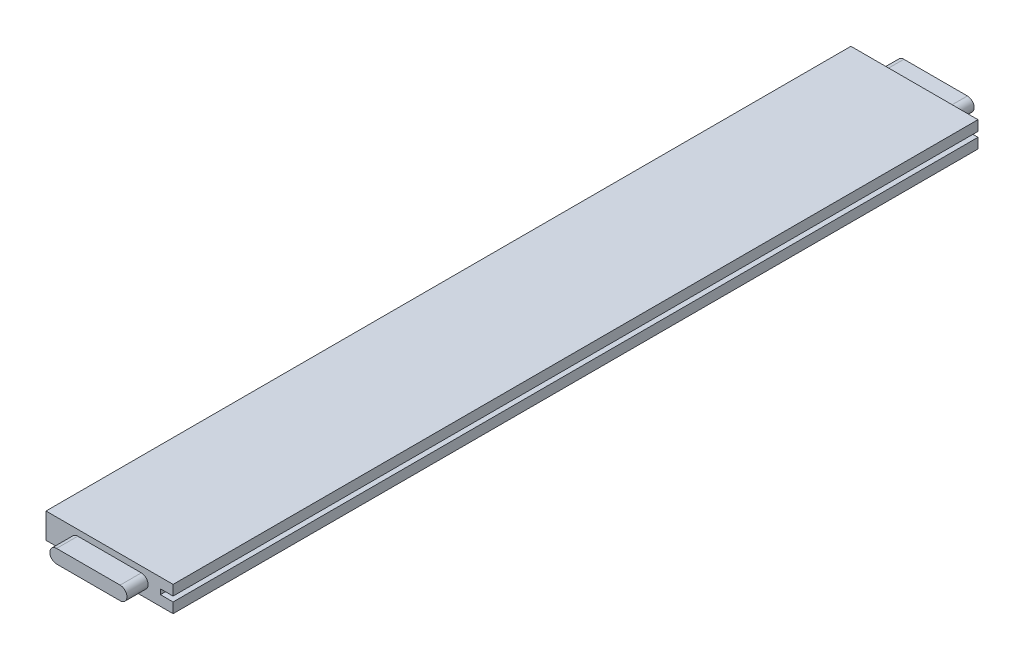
ISO-10303-21;
HEADER;
FILE_DESCRIPTION(('STEP AP214'),'2;1');
FILE_NAME('part.step','',(''),(''),'','','');
FILE_SCHEMA(('AUTOMOTIVE_DESIGN { 1 0 10303 214 1 1 1 1 }'));
ENDSEC;
DATA;
#1=APPLICATION_CONTEXT('core data for automotive mechanical design processes');
#2=APPLICATION_PROTOCOL_DEFINITION('international standard','automotive_design',2000,#1);
#3=PRODUCT_CONTEXT('',#1,'mechanical');
#4=PRODUCT('Part','Part','',(#3));
#5=PRODUCT_RELATED_PRODUCT_CATEGORY('part','',(#4));
#6=PRODUCT_DEFINITION_FORMATION('','',#4);
#7=PRODUCT_DEFINITION_CONTEXT('part definition',#1,'design');
#8=PRODUCT_DEFINITION('design','',#6,#7);
#9=PRODUCT_DEFINITION_SHAPE('','',#8);
#10=(LENGTH_UNIT() NAMED_UNIT(*) SI_UNIT(.MILLI.,.METRE.));
#11=(NAMED_UNIT(*) PLANE_ANGLE_UNIT() SI_UNIT($,.RADIAN.));
#12=(NAMED_UNIT(*) SI_UNIT($,.STERADIAN.) SOLID_ANGLE_UNIT());
#13=UNCERTAINTY_MEASURE_WITH_UNIT(LENGTH_MEASURE(1.E-05),#10,'distance_accuracy_value','');
#14=(GEOMETRIC_REPRESENTATION_CONTEXT(3) GLOBAL_UNCERTAINTY_ASSIGNED_CONTEXT((#13)) GLOBAL_UNIT_ASSIGNED_CONTEXT((#10,
#11,#12)) REPRESENTATION_CONTEXT('',''));
#15=CARTESIAN_POINT('',(0.,0.,0.));
#16=DIRECTION('',(0.,0.,1.));
#17=DIRECTION('',(1.,0.,0.));
#18=AXIS2_PLACEMENT_3D('',#15,#16,#17);
#19=CARTESIAN_POINT('',(75.,15.,-525.));
#20=DIRECTION('',(1.,0.,0.));
#21=DIRECTION('',(0.,0.,-1.));
#22=AXIS2_PLACEMENT_3D('',#19,#20,#21);
#23=PLANE('',#22);
#24=DIRECTION('',(0.,1.,0.));
#25=VECTOR('',#24,1.);
#26=CARTESIAN_POINT('',(75.,-15.,-475.));
#27=LINE('',#26,#25);
#28=CARTESIAN_POINT('',(75.,-15.,-475.));
#29=VERTEX_POINT('',#28);
#30=CARTESIAN_POINT('',(74.9999999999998,-3.00000000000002,-475.));
#31=VERTEX_POINT('',#30);
#32=EDGE_CURVE('E190',#29,#31,#27,.T.);
#33=ORIENTED_EDGE('',*,*,#32,.T.);
#34=DIRECTION('',(0.,0.,-1.));
#35=VECTOR('',#34,1.);
#36=CARTESIAN_POINT('',(74.9999999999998,-3.00000000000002,500.));
#37=LINE('',#36,#35);
#38=CARTESIAN_POINT('',(74.9999999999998,-3.00000000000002,475.));
#39=VERTEX_POINT('',#38);
#40=EDGE_CURVE('E265',#39,#31,#37,.T.);
#41=ORIENTED_EDGE('',*,*,#40,.F.);
#42=DIRECTION('',(0.,1.,0.));
#43=VECTOR('',#42,1.);
#44=CARTESIAN_POINT('',(75.,-15.,475.));
#45=LINE('',#44,#43);
#46=CARTESIAN_POINT('',(75.,-15.,475.));
#47=VERTEX_POINT('',#46);
#48=EDGE_CURVE('E259',#47,#39,#45,.T.);
#49=ORIENTED_EDGE('',*,*,#48,.F.);
#50=DIRECTION('',(0.,0.,1.));
#51=VECTOR('',#50,1.);
#52=CARTESIAN_POINT('',(75.,-15.,-525.));
#53=LINE('',#52,#51);
#54=EDGE_CURVE('E273',#29,#47,#53,.T.);
#55=ORIENTED_EDGE('',*,*,#54,.F.);
#56=EDGE_LOOP('',(#33,#41,#49,#55));
#57=FACE_BOUND('',#56,.T.);
#58=ADVANCED_FACE('F34',(#57),#23,.T.);
#59=CARTESIAN_POINT('',(-75.,15.,-525.));
#60=DIRECTION('',(-1.,0.,0.));
#61=DIRECTION('',(0.,0.,1.));
#62=AXIS2_PLACEMENT_3D('',#59,#60,#61);
#63=PLANE('',#62);
#64=DIRECTION('',(0.,-1.,0.));
#65=VECTOR('',#64,1.);
#66=CARTESIAN_POINT('',(-75.,15.,-475.));
#67=LINE('',#66,#65);
#68=CARTESIAN_POINT('',(-75.,15.,-475.));
#69=VERTEX_POINT('',#68);
#70=CARTESIAN_POINT('',(-75.,-15.,-475.));
#71=VERTEX_POINT('',#70);
#72=EDGE_CURVE('E196',#69,#71,#67,.T.);
#73=ORIENTED_EDGE('',*,*,#72,.T.);
#74=DIRECTION('',(0.,0.,1.));
#75=VECTOR('',#74,1.);
#76=CARTESIAN_POINT('',(-75.,-15.,-525.));
#77=LINE('',#76,#75);
#78=CARTESIAN_POINT('',(-75.,-15.,475.));
#79=VERTEX_POINT('',#78);
#80=EDGE_CURVE('E38',#71,#79,#77,.T.);
#81=ORIENTED_EDGE('',*,*,#80,.T.);
#82=DIRECTION('',(0.,-1.,0.));
#83=VECTOR('',#82,1.);
#84=CARTESIAN_POINT('',(-75.,15.,475.));
#85=LINE('',#84,#83);
#86=CARTESIAN_POINT('',(-75.,15.,475.));
#87=VERTEX_POINT('',#86);
#88=EDGE_CURVE('E253',#87,#79,#85,.T.);
#89=ORIENTED_EDGE('',*,*,#88,.F.);
#90=DIRECTION('',(0.,0.,1.));
#91=VECTOR('',#90,1.);
#92=CARTESIAN_POINT('',(-75.,15.,-525.));
#93=LINE('',#92,#91);
#94=EDGE_CURVE('E11',#69,#87,#93,.T.);
#95=ORIENTED_EDGE('',*,*,#94,.F.);
#96=EDGE_LOOP('',(#73,#81,#89,#95));
#97=FACE_BOUND('',#96,.T.);
#98=ADVANCED_FACE('F36',(#97),#63,.T.);
#99=CARTESIAN_POINT('',(-75.,15.,-525.));
#100=DIRECTION('',(0.,1.,0.));
#101=DIRECTION('',(0.,0.,1.));
#102=AXIS2_PLACEMENT_3D('',#99,#100,#101);
#103=PLANE('',#102);
#104=DIRECTION('',(-1.,0.,0.));
#105=VECTOR('',#104,1.);
#106=CARTESIAN_POINT('',(75.,15.,-475.));
#107=LINE('',#106,#105);
#108=CARTESIAN_POINT('',(75.,15.,-475.));
#109=VERTEX_POINT('',#108);
#110=EDGE_CURVE('E199',#109,#69,#107,.T.);
#111=ORIENTED_EDGE('',*,*,#110,.T.);
#112=ORIENTED_EDGE('',*,*,#94,.T.);
#113=DIRECTION('',(-1.,0.,0.));
#114=VECTOR('',#113,1.);
#115=CARTESIAN_POINT('',(75.,15.,475.));
#116=LINE('',#115,#114);
#117=CARTESIAN_POINT('',(75.,15.,475.));
#118=VERTEX_POINT('',#117);
#119=EDGE_CURVE('E250',#118,#87,#116,.T.);
#120=ORIENTED_EDGE('',*,*,#119,.F.);
#121=DIRECTION('',(0.,0.,1.));
#122=VECTOR('',#121,1.);
#123=CARTESIAN_POINT('',(75.,15.,-525.));
#124=LINE('',#123,#122);
#125=EDGE_CURVE('E43',#109,#118,#124,.T.);
#126=ORIENTED_EDGE('',*,*,#125,.F.);
#127=EDGE_LOOP('',(#111,#112,#120,#126));
#128=FACE_BOUND('',#127,.T.);
#129=ADVANCED_FACE('F296',(#128),#103,.T.);
#130=DIRECTION('',(0.,1.,0.));
#131=VECTOR('',#130,1.);
#132=CARTESIAN_POINT('',(75.,2.99999999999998,-475.));
#133=LINE('',#132,#131);
#134=CARTESIAN_POINT('',(74.9999999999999,2.99999999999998,-475.));
#135=VERTEX_POINT('',#134);
#136=EDGE_CURVE('E59',#135,#109,#133,.T.);
#137=ORIENTED_EDGE('',*,*,#136,.T.);
#138=ORIENTED_EDGE('',*,*,#125,.T.);
#139=DIRECTION('',(0.,1.,0.));
#140=VECTOR('',#139,1.);
#141=CARTESIAN_POINT('',(75.,2.99999999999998,475.));
#142=LINE('',#141,#140);
#143=CARTESIAN_POINT('',(75.,2.99999999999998,475.));
#144=VERTEX_POINT('',#143);
#145=EDGE_CURVE('E247',#144,#118,#142,.T.);
#146=ORIENTED_EDGE('',*,*,#145,.F.);
#147=DIRECTION('',(0.,0.,-1.));
#148=VECTOR('',#147,1.);
#149=CARTESIAN_POINT('',(74.9999999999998,2.99999999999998,500.));
#150=LINE('',#149,#148);
#151=EDGE_CURVE('E268',#144,#135,#150,.T.);
#152=ORIENTED_EDGE('',*,*,#151,.T.);
#153=EDGE_LOOP('',(#137,#138,#146,#152));
#154=FACE_BOUND('',#153,.T.);
#155=ADVANCED_FACE('F288',(#154),#23,.T.);
#156=CARTESIAN_POINT('',(75.,-15.,-525.));
#157=DIRECTION('',(0.,-1.,0.));
#158=DIRECTION('',(1.,0.,0.));
#159=AXIS2_PLACEMENT_3D('',#156,#157,#158);
#160=PLANE('',#159);
#161=DIRECTION('',(1.,0.,0.));
#162=VECTOR('',#161,1.);
#163=CARTESIAN_POINT('',(-75.,-15.,-475.));
#164=LINE('',#163,#162);
#165=EDGE_CURVE('E193',#71,#29,#164,.T.);
#166=ORIENTED_EDGE('',*,*,#165,.T.);
#167=ORIENTED_EDGE('',*,*,#54,.T.);
#168=DIRECTION('',(1.,0.,0.));
#169=VECTOR('',#168,1.);
#170=CARTESIAN_POINT('',(-75.,-15.,475.));
#171=LINE('',#170,#169);
#172=EDGE_CURVE('E256',#79,#47,#171,.T.);
#173=ORIENTED_EDGE('',*,*,#172,.F.);
#174=ORIENTED_EDGE('',*,*,#80,.F.);
#175=EDGE_LOOP('',(#166,#167,#173,#174));
#176=FACE_BOUND('',#175,.T.);
#177=ADVANCED_FACE('F285',(#176),#160,.T.);
#178=CARTESIAN_POINT('',(59.9999999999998,-3.00000000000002,500.));
#179=DIRECTION('',(-1.,0.,0.));
#180=DIRECTION('',(0.,0.,1.));
#181=AXIS2_PLACEMENT_3D('',#178,#179,#180);
#182=PLANE('',#181);
#183=DIRECTION('',(0.,0.,-1.));
#184=VECTOR('',#183,1.);
#185=CARTESIAN_POINT('',(59.9999999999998,-3.00000000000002,500.));
#186=LINE('',#185,#184);
#187=CARTESIAN_POINT('',(59.9999999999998,-3.00000000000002,475.));
#188=VERTEX_POINT('',#187);
#189=CARTESIAN_POINT('',(59.9999999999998,-3.00000000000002,-475.));
#190=VERTEX_POINT('',#189);
#191=EDGE_CURVE('E262',#188,#190,#186,.T.);
#192=ORIENTED_EDGE('',*,*,#191,.T.);
#193=DIRECTION('',(0.,1.,0.));
#194=VECTOR('',#193,1.);
#195=CARTESIAN_POINT('',(59.9999999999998,-3.00000000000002,-475.));
#196=LINE('',#195,#194);
#197=CARTESIAN_POINT('',(59.9999999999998,2.99999999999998,-475.));
#198=VERTEX_POINT('',#197);
#199=EDGE_CURVE('E205',#190,#198,#196,.T.);
#200=ORIENTED_EDGE('',*,*,#199,.T.);
#201=DIRECTION('',(0.,0.,-1.));
#202=VECTOR('',#201,1.);
#203=CARTESIAN_POINT('',(59.9999999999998,2.99999999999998,500.));
#204=LINE('',#203,#202);
#205=CARTESIAN_POINT('',(59.9999999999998,2.99999999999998,475.));
#206=VERTEX_POINT('',#205);
#207=EDGE_CURVE('E261',#206,#198,#204,.T.);
#208=ORIENTED_EDGE('',*,*,#207,.F.);
#209=DIRECTION('',(0.,1.,0.));
#210=VECTOR('',#209,1.);
#211=CARTESIAN_POINT('',(59.9999999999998,-3.00000000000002,475.));
#212=LINE('',#211,#210);
#213=EDGE_CURVE('E243',#188,#206,#212,.T.);
#214=ORIENTED_EDGE('',*,*,#213,.F.);
#215=EDGE_LOOP('',(#192,#200,#208,#214));
#216=FACE_BOUND('',#215,.T.);
#217=ADVANCED_FACE('F287',(#216),#182,.F.);
#218=CARTESIAN_POINT('',(59.9999999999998,-3.00000000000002,500.));
#219=DIRECTION('',(0.,-1.,0.));
#220=DIRECTION('',(1.,0.,0.));
#221=AXIS2_PLACEMENT_3D('',#218,#219,#220);
#222=PLANE('',#221);
#223=ORIENTED_EDGE('',*,*,#40,.T.);
#224=DIRECTION('',(-1.,0.,0.));
#225=VECTOR('',#224,1.);
#226=CARTESIAN_POINT('',(74.9999999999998,-3.00000000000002,-475.));
#227=LINE('',#226,#225);
#228=EDGE_CURVE('E184',#31,#190,#227,.T.);
#229=ORIENTED_EDGE('',*,*,#228,.T.);
#230=ORIENTED_EDGE('',*,*,#191,.F.);
#231=DIRECTION('',(-1.,0.,0.));
#232=VECTOR('',#231,1.);
#233=CARTESIAN_POINT('',(74.9999999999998,-3.00000000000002,475.));
#234=LINE('',#233,#232);
#235=EDGE_CURVE('E235',#39,#188,#234,.T.);
#236=ORIENTED_EDGE('',*,*,#235,.F.);
#237=EDGE_LOOP('',(#223,#229,#230,#236));
#238=FACE_BOUND('',#237,.T.);
#239=ADVANCED_FACE('F293',(#238),#222,.F.);
#240=CARTESIAN_POINT('',(59.9999999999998,2.99999999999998,500.));
#241=DIRECTION('',(0.,1.,0.));
#242=DIRECTION('',(-1.,0.,0.));
#243=AXIS2_PLACEMENT_3D('',#240,#241,#242);
#244=PLANE('',#243);
#245=ORIENTED_EDGE('',*,*,#207,.T.);
#246=DIRECTION('',(1.,0.,0.));
#247=VECTOR('',#246,1.);
#248=CARTESIAN_POINT('',(59.9999999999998,2.99999999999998,-475.));
#249=LINE('',#248,#247);
#250=EDGE_CURVE('E203',#198,#135,#249,.T.);
#251=ORIENTED_EDGE('',*,*,#250,.T.);
#252=ORIENTED_EDGE('',*,*,#151,.F.);
#253=DIRECTION('',(1.,0.,0.));
#254=VECTOR('',#253,1.);
#255=CARTESIAN_POINT('',(59.9999999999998,2.99999999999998,475.));
#256=LINE('',#255,#254);
#257=EDGE_CURVE('E245',#206,#144,#256,.T.);
#258=ORIENTED_EDGE('',*,*,#257,.F.);
#259=EDGE_LOOP('',(#245,#251,#252,#258));
#260=FACE_BOUND('',#259,.T.);
#261=ADVANCED_FACE('F317',(#260),#244,.F.);
#262=CARTESIAN_POINT('',(0.,0.,475.));
#263=DIRECTION('',(0.,0.,-1.));
#264=DIRECTION('',(-1.,0.,0.));
#265=AXIS2_PLACEMENT_3D('',#262,#263,#264);
#266=PLANE('',#265);
#267=CARTESIAN_POINT('',(-37.5,0.,475.));
#268=DIRECTION('',(0.,0.,1.));
#269=DIRECTION('',(1.,0.,0.));
#270=AXIS2_PLACEMENT_3D('',#267,#268,#269);
#271=CIRCLE('',#270,8.);
#272=CARTESIAN_POINT('',(-37.5,8.,475.));
#273=VERTEX_POINT('',#272);
#274=CARTESIAN_POINT('',(-37.5,-8.,475.));
#275=VERTEX_POINT('',#274);
#276=EDGE_CURVE('E209',#273,#275,#271,.T.);
#277=ORIENTED_EDGE('',*,*,#276,.F.);
#278=DIRECTION('',(-1.,0.,0.));
#279=VECTOR('',#278,1.);
#280=CARTESIAN_POINT('',(-37.5,8.,475.));
#281=LINE('',#280,#279);
#282=CARTESIAN_POINT('',(37.5,8.,475.));
#283=VERTEX_POINT('',#282);
#284=EDGE_CURVE('E219',#283,#273,#281,.T.);
#285=ORIENTED_EDGE('',*,*,#284,.F.);
#286=CARTESIAN_POINT('',(37.5,0.,475.));
#287=DIRECTION('',(0.,0.,1.));
#288=DIRECTION('',(1.,0.,0.));
#289=AXIS2_PLACEMENT_3D('',#286,#287,#288);
#290=CIRCLE('',#289,8.);
#291=CARTESIAN_POINT('',(37.5,-8.,475.));
#292=VERTEX_POINT('',#291);
#293=EDGE_CURVE('E216',#292,#283,#290,.T.);
#294=ORIENTED_EDGE('',*,*,#293,.F.);
#295=DIRECTION('',(1.,0.,0.));
#296=VECTOR('',#295,1.);
#297=CARTESIAN_POINT('',(-37.5,-8.,475.));
#298=LINE('',#297,#296);
#299=EDGE_CURVE('E212',#275,#292,#298,.T.);
#300=ORIENTED_EDGE('',*,*,#299,.F.);
#301=EDGE_LOOP('',(#277,#285,#294,#300));
#302=FACE_BOUND('',#301,.T.);
#303=ORIENTED_EDGE('',*,*,#235,.T.);
#304=ORIENTED_EDGE('',*,*,#213,.T.);
#305=ORIENTED_EDGE('',*,*,#257,.T.);
#306=ORIENTED_EDGE('',*,*,#145,.T.);
#307=ORIENTED_EDGE('',*,*,#119,.T.);
#308=ORIENTED_EDGE('',*,*,#88,.T.);
#309=ORIENTED_EDGE('',*,*,#172,.T.);
#310=ORIENTED_EDGE('',*,*,#48,.T.);
#311=EDGE_LOOP('',(#303,#304,#305,#306,#307,#308,#309,#310));
#312=FACE_BOUND('',#311,.T.);
#313=ADVANCED_FACE('F282',(#302,#312),#266,.F.);
#314=CARTESIAN_POINT('',(-37.5,0.,475.));
#315=DIRECTION('',(0.,0.,1.));
#316=DIRECTION('',(1.,0.,0.));
#317=AXIS2_PLACEMENT_3D('',#314,#315,#316);
#318=CYLINDRICAL_SURFACE('',#317,8.);
#319=CARTESIAN_POINT('',(-37.5,0.,500.));
#320=DIRECTION('',(0.,0.,1.));
#321=DIRECTION('',(1.,0.,0.));
#322=AXIS2_PLACEMENT_3D('',#319,#320,#321);
#323=CIRCLE('',#322,8.);
#324=CARTESIAN_POINT('',(-37.5,8.,500.));
#325=VERTEX_POINT('',#324);
#326=CARTESIAN_POINT('',(-37.5,-8.,500.));
#327=VERTEX_POINT('',#326);
#328=EDGE_CURVE('E208',#325,#327,#323,.T.);
#329=ORIENTED_EDGE('',*,*,#328,.F.);
#330=DIRECTION('',(0.,0.,1.));
#331=VECTOR('',#330,1.);
#332=CARTESIAN_POINT('',(-37.5,8.,475.));
#333=LINE('',#332,#331);
#334=EDGE_CURVE('E233',#273,#325,#333,.T.);
#335=ORIENTED_EDGE('',*,*,#334,.F.);
#336=ORIENTED_EDGE('',*,*,#276,.T.);
#337=DIRECTION('',(0.,0.,1.));
#338=VECTOR('',#337,1.);
#339=CARTESIAN_POINT('',(-37.5,-8.,475.));
#340=LINE('',#339,#338);
#341=EDGE_CURVE('E222',#275,#327,#340,.T.);
#342=ORIENTED_EDGE('',*,*,#341,.T.);
#343=EDGE_LOOP('',(#329,#335,#336,#342));
#344=FACE_BOUND('',#343,.T.);
#345=ADVANCED_FACE('F326',(#344),#318,.T.);
#346=CARTESIAN_POINT('',(-37.5,8.,475.));
#347=DIRECTION('',(0.,1.,0.));
#348=DIRECTION('',(0.,0.,1.));
#349=AXIS2_PLACEMENT_3D('',#346,#347,#348);
#350=PLANE('',#349);
#351=DIRECTION('',(-1.,0.,0.));
#352=VECTOR('',#351,1.);
#353=CARTESIAN_POINT('',(-37.5,8.,500.));
#354=LINE('',#353,#352);
#355=CARTESIAN_POINT('',(37.5,8.,500.));
#356=VERTEX_POINT('',#355);
#357=EDGE_CURVE('E213',#356,#325,#354,.T.);
#358=ORIENTED_EDGE('',*,*,#357,.F.);
#359=DIRECTION('',(0.,0.,1.));
#360=VECTOR('',#359,1.);
#361=CARTESIAN_POINT('',(37.5,8.,475.));
#362=LINE('',#361,#360);
#363=EDGE_CURVE('E236',#283,#356,#362,.T.);
#364=ORIENTED_EDGE('',*,*,#363,.F.);
#365=ORIENTED_EDGE('',*,*,#284,.T.);
#366=ORIENTED_EDGE('',*,*,#334,.T.);
#367=EDGE_LOOP('',(#358,#364,#365,#366));
#368=FACE_BOUND('',#367,.T.);
#369=ADVANCED_FACE('F330',(#368),#350,.T.);
#370=CARTESIAN_POINT('',(37.5,0.,475.));
#371=DIRECTION('',(0.,0.,1.));
#372=DIRECTION('',(1.,0.,0.));
#373=AXIS2_PLACEMENT_3D('',#370,#371,#372);
#374=CYLINDRICAL_SURFACE('',#373,8.);
#375=CARTESIAN_POINT('',(37.5,0.,500.));
#376=DIRECTION('',(0.,0.,1.));
#377=DIRECTION('',(1.,0.,0.));
#378=AXIS2_PLACEMENT_3D('',#375,#376,#377);
#379=CIRCLE('',#378,8.);
#380=CARTESIAN_POINT('',(37.5,-8.,500.));
#381=VERTEX_POINT('',#380);
#382=EDGE_CURVE('E228',#381,#356,#379,.T.);
#383=ORIENTED_EDGE('',*,*,#382,.F.);
#384=DIRECTION('',(0.,0.,1.));
#385=VECTOR('',#384,1.);
#386=CARTESIAN_POINT('',(37.5,-8.,475.));
#387=LINE('',#386,#385);
#388=EDGE_CURVE('E238',#292,#381,#387,.T.);
#389=ORIENTED_EDGE('',*,*,#388,.F.);
#390=ORIENTED_EDGE('',*,*,#293,.T.);
#391=ORIENTED_EDGE('',*,*,#363,.T.);
#392=EDGE_LOOP('',(#383,#389,#390,#391));
#393=FACE_BOUND('',#392,.T.);
#394=ADVANCED_FACE('F334',(#393),#374,.T.);
#395=CARTESIAN_POINT('',(-37.5,-8.,475.));
#396=DIRECTION('',(0.,-1.,0.));
#397=DIRECTION('',(0.,0.,-1.));
#398=AXIS2_PLACEMENT_3D('',#395,#396,#397);
#399=PLANE('',#398);
#400=DIRECTION('',(1.,0.,0.));
#401=VECTOR('',#400,1.);
#402=CARTESIAN_POINT('',(-37.5,-8.,500.));
#403=LINE('',#402,#401);
#404=EDGE_CURVE('E225',#327,#381,#403,.T.);
#405=ORIENTED_EDGE('',*,*,#404,.F.);
#406=ORIENTED_EDGE('',*,*,#341,.F.);
#407=ORIENTED_EDGE('',*,*,#299,.T.);
#408=ORIENTED_EDGE('',*,*,#388,.T.);
#409=EDGE_LOOP('',(#405,#406,#407,#408));
#410=FACE_BOUND('',#409,.T.);
#411=ADVANCED_FACE('F314',(#410),#399,.T.);
#412=CARTESIAN_POINT('',(75.,-15.,500.));
#413=DIRECTION('',(0.,0.,-1.));
#414=DIRECTION('',(-1.,0.,0.));
#415=AXIS2_PLACEMENT_3D('',#412,#413,#414);
#416=PLANE('',#415);
#417=ORIENTED_EDGE('',*,*,#328,.T.);
#418=ORIENTED_EDGE('',*,*,#404,.T.);
#419=ORIENTED_EDGE('',*,*,#382,.T.);
#420=ORIENTED_EDGE('',*,*,#357,.T.);
#421=EDGE_LOOP('',(#417,#418,#419,#420));
#422=FACE_BOUND('',#421,.T.);
#423=ADVANCED_FACE('F312',(#422),#416,.F.);
#424=CARTESIAN_POINT('',(0.,0.,-475.));
#425=DIRECTION('',(0.,0.,1.));
#426=DIRECTION('',(-1.,0.,0.));
#427=AXIS2_PLACEMENT_3D('',#424,#425,#426);
#428=PLANE('',#427);
#429=ORIENTED_EDGE('',*,*,#228,.F.);
#430=ORIENTED_EDGE('',*,*,#32,.F.);
#431=ORIENTED_EDGE('',*,*,#165,.F.);
#432=ORIENTED_EDGE('',*,*,#72,.F.);
#433=ORIENTED_EDGE('',*,*,#110,.F.);
#434=ORIENTED_EDGE('',*,*,#136,.F.);
#435=ORIENTED_EDGE('',*,*,#250,.F.);
#436=ORIENTED_EDGE('',*,*,#199,.F.);
#437=EDGE_LOOP('',(#429,#430,#431,#432,#433,#434,#435,#436));
#438=FACE_BOUND('',#437,.T.);
#439=DIRECTION('',(1.,0.,0.));
#440=VECTOR('',#439,1.);
#441=CARTESIAN_POINT('',(-37.5,-8.,-475.));
#442=LINE('',#441,#440);
#443=CARTESIAN_POINT('',(-37.5,-8.,-475.));
#444=VERTEX_POINT('',#443);
#445=CARTESIAN_POINT('',(37.5,-8.,-475.));
#446=VERTEX_POINT('',#445);
#447=EDGE_CURVE('E167',#444,#446,#442,.T.);
#448=ORIENTED_EDGE('',*,*,#447,.T.);
#449=CARTESIAN_POINT('',(37.5,0.,-475.));
#450=DIRECTION('',(0.,0.,1.));
#451=DIRECTION('',(1.,0.,0.));
#452=AXIS2_PLACEMENT_3D('',#449,#450,#451);
#453=CIRCLE('',#452,8.);
#454=CARTESIAN_POINT('',(37.5,8.,-475.));
#455=VERTEX_POINT('',#454);
#456=EDGE_CURVE('E155',#446,#455,#453,.T.);
#457=ORIENTED_EDGE('',*,*,#456,.T.);
#458=DIRECTION('',(-1.,0.,0.));
#459=VECTOR('',#458,1.);
#460=CARTESIAN_POINT('',(-37.5,8.,-475.));
#461=LINE('',#460,#459);
#462=CARTESIAN_POINT('',(-37.5,8.,-475.));
#463=VERTEX_POINT('',#462);
#464=EDGE_CURVE('E148',#455,#463,#461,.T.);
#465=ORIENTED_EDGE('',*,*,#464,.T.);
#466=CARTESIAN_POINT('',(-37.5,0.,-475.));
#467=DIRECTION('',(0.,0.,1.));
#468=DIRECTION('',(1.,0.,0.));
#469=AXIS2_PLACEMENT_3D('',#466,#467,#468);
#470=CIRCLE('',#469,8.);
#471=EDGE_CURVE('E152',#463,#444,#470,.T.);
#472=ORIENTED_EDGE('',*,*,#471,.T.);
#473=EDGE_LOOP('',(#448,#457,#465,#472));
#474=FACE_BOUND('',#473,.T.);
#475=ADVANCED_FACE('F150',(#438,#474),#428,.F.);
#476=CARTESIAN_POINT('',(-37.5,0.,-475.));
#477=DIRECTION('',(0.,0.,-1.));
#478=DIRECTION('',(-1.,0.,0.));
#479=AXIS2_PLACEMENT_3D('',#476,#477,#478);
#480=CYLINDRICAL_SURFACE('',#479,8.);
#481=CARTESIAN_POINT('',(-37.5,0.,-500.));
#482=DIRECTION('',(0.,0.,1.));
#483=DIRECTION('',(1.,0.,0.));
#484=AXIS2_PLACEMENT_3D('',#481,#482,#483);
#485=CIRCLE('',#484,8.);
#486=CARTESIAN_POINT('',(-37.5,8.,-500.));
#487=VERTEX_POINT('',#486);
#488=CARTESIAN_POINT('',(-37.5,-8.,-500.));
#489=VERTEX_POINT('',#488);
#490=EDGE_CURVE('E179',#487,#489,#485,.T.);
#491=ORIENTED_EDGE('',*,*,#490,.T.);
#492=DIRECTION('',(0.,0.,-1.));
#493=VECTOR('',#492,1.);
#494=CARTESIAN_POINT('',(-37.5,-8.,-475.));
#495=LINE('',#494,#493);
#496=EDGE_CURVE('E170',#444,#489,#495,.T.);
#497=ORIENTED_EDGE('',*,*,#496,.F.);
#498=ORIENTED_EDGE('',*,*,#471,.F.);
#499=DIRECTION('',(0.,0.,-1.));
#500=VECTOR('',#499,1.);
#501=CARTESIAN_POINT('',(-37.5,8.,-475.));
#502=LINE('',#501,#500);
#503=EDGE_CURVE('E159',#463,#487,#502,.T.);
#504=ORIENTED_EDGE('',*,*,#503,.T.);
#505=EDGE_LOOP('',(#491,#497,#498,#504));
#506=FACE_BOUND('',#505,.T.);
#507=ADVANCED_FACE('F169',(#506),#480,.T.);
#508=CARTESIAN_POINT('',(-37.5,-8.,-475.));
#509=DIRECTION('',(0.,1.,0.));
#510=DIRECTION('',(0.,0.,1.));
#511=AXIS2_PLACEMENT_3D('',#508,#509,#510);
#512=PLANE('',#511);
#513=DIRECTION('',(1.,0.,0.));
#514=VECTOR('',#513,1.);
#515=CARTESIAN_POINT('',(-37.5,-8.,-500.));
#516=LINE('',#515,#514);
#517=CARTESIAN_POINT('',(37.5,-8.,-500.));
#518=VERTEX_POINT('',#517);
#519=EDGE_CURVE('E172',#489,#518,#516,.T.);
#520=ORIENTED_EDGE('',*,*,#519,.T.);
#521=DIRECTION('',(0.,0.,-1.));
#522=VECTOR('',#521,1.);
#523=CARTESIAN_POINT('',(37.5,-8.,-475.));
#524=LINE('',#523,#522);
#525=EDGE_CURVE('E185',#446,#518,#524,.T.);
#526=ORIENTED_EDGE('',*,*,#525,.F.);
#527=ORIENTED_EDGE('',*,*,#447,.F.);
#528=ORIENTED_EDGE('',*,*,#496,.T.);
#529=EDGE_LOOP('',(#520,#526,#527,#528));
#530=FACE_BOUND('',#529,.T.);
#531=ADVANCED_FACE('F346',(#530),#512,.F.);
#532=CARTESIAN_POINT('',(37.5,0.,-475.));
#533=DIRECTION('',(0.,0.,-1.));
#534=DIRECTION('',(-1.,0.,0.));
#535=AXIS2_PLACEMENT_3D('',#532,#533,#534);
#536=CYLINDRICAL_SURFACE('',#535,8.);
#537=CARTESIAN_POINT('',(37.5,0.,-500.));
#538=DIRECTION('',(0.,0.,1.));
#539=DIRECTION('',(1.,0.,0.));
#540=AXIS2_PLACEMENT_3D('',#537,#538,#539);
#541=CIRCLE('',#540,8.);
#542=CARTESIAN_POINT('',(37.5,8.,-500.));
#543=VERTEX_POINT('',#542);
#544=EDGE_CURVE('E51',#518,#543,#541,.T.);
#545=ORIENTED_EDGE('',*,*,#544,.T.);
#546=DIRECTION('',(0.,0.,-1.));
#547=VECTOR('',#546,1.);
#548=CARTESIAN_POINT('',(37.5,8.,-475.));
#549=LINE('',#548,#547);
#550=EDGE_CURVE('E166',#455,#543,#549,.T.);
#551=ORIENTED_EDGE('',*,*,#550,.F.);
#552=ORIENTED_EDGE('',*,*,#456,.F.);
#553=ORIENTED_EDGE('',*,*,#525,.T.);
#554=EDGE_LOOP('',(#545,#551,#552,#553));
#555=FACE_BOUND('',#554,.T.);
#556=ADVANCED_FACE('F349',(#555),#536,.T.);
#557=CARTESIAN_POINT('',(-37.5,8.,-475.));
#558=DIRECTION('',(0.,-1.,0.));
#559=DIRECTION('',(0.,0.,-1.));
#560=AXIS2_PLACEMENT_3D('',#557,#558,#559);
#561=PLANE('',#560);
#562=DIRECTION('',(-1.,0.,0.));
#563=VECTOR('',#562,1.);
#564=CARTESIAN_POINT('',(-37.5,8.,-500.));
#565=LINE('',#564,#563);
#566=EDGE_CURVE('E162',#543,#487,#565,.T.);
#567=ORIENTED_EDGE('',*,*,#566,.T.);
#568=ORIENTED_EDGE('',*,*,#503,.F.);
#569=ORIENTED_EDGE('',*,*,#464,.F.);
#570=ORIENTED_EDGE('',*,*,#550,.T.);
#571=EDGE_LOOP('',(#567,#568,#569,#570));
#572=FACE_BOUND('',#571,.T.);
#573=ADVANCED_FACE('F160',(#572),#561,.F.);
#574=CARTESIAN_POINT('',(-75.,-15.,-500.));
#575=DIRECTION('',(0.,0.,1.));
#576=DIRECTION('',(1.,0.,0.));
#577=AXIS2_PLACEMENT_3D('',#574,#575,#576);
#578=PLANE('',#577);
#579=ORIENTED_EDGE('',*,*,#519,.F.);
#580=ORIENTED_EDGE('',*,*,#490,.F.);
#581=ORIENTED_EDGE('',*,*,#566,.F.);
#582=ORIENTED_EDGE('',*,*,#544,.F.);
#583=EDGE_LOOP('',(#579,#580,#581,#582));
#584=FACE_BOUND('',#583,.T.);
#585=ADVANCED_FACE('F308',(#584),#578,.F.);
#586=CLOSED_SHELL('',(#58,#98,#129,#155,#177,#217,#239,#261,#313,#345,#369,#394,#411,#423,#475,
#507,#531,#556,#573,#585));
#587=MANIFOLD_SOLID_BREP('B2',#586);
#588=ADVANCED_BREP_SHAPE_REPRESENTATION('',(#18,#587),#14);
#589=SHAPE_DEFINITION_REPRESENTATION(#9,#588);
ENDSEC;
END-ISO-10303-21;
